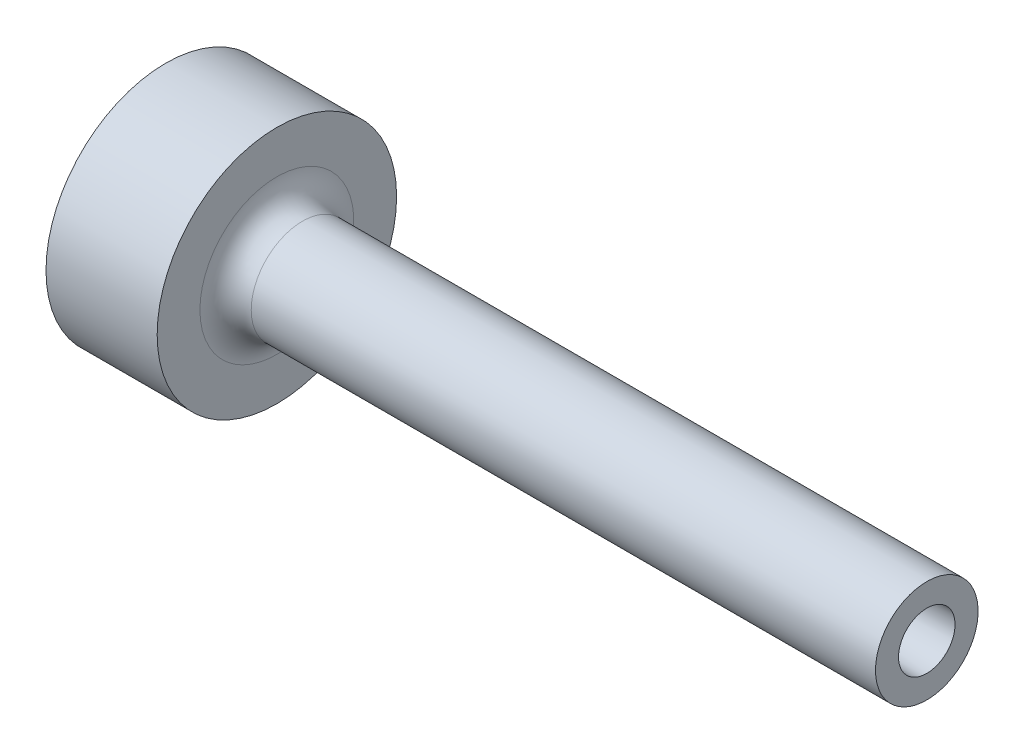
ISO-10303-21;
HEADER;
FILE_DESCRIPTION(('STEP AP214'),'2;1');
FILE_NAME('part.step','',(''),(''),'','','');
FILE_SCHEMA(('AUTOMOTIVE_DESIGN { 1 0 10303 214 1 1 1 1 }'));
ENDSEC;
DATA;
#1=APPLICATION_CONTEXT('core data for automotive mechanical design processes');
#2=APPLICATION_PROTOCOL_DEFINITION('international standard','automotive_design',2000,#1);
#3=PRODUCT_CONTEXT('',#1,'mechanical');
#4=PRODUCT('Part','Part','',(#3));
#5=PRODUCT_RELATED_PRODUCT_CATEGORY('part','',(#4));
#6=PRODUCT_DEFINITION_FORMATION('','',#4);
#7=PRODUCT_DEFINITION_CONTEXT('part definition',#1,'design');
#8=PRODUCT_DEFINITION('design','',#6,#7);
#9=PRODUCT_DEFINITION_SHAPE('','',#8);
#10=(LENGTH_UNIT() NAMED_UNIT(*) SI_UNIT(.MILLI.,.METRE.));
#11=(NAMED_UNIT(*) PLANE_ANGLE_UNIT() SI_UNIT($,.RADIAN.));
#12=(NAMED_UNIT(*) SI_UNIT($,.STERADIAN.) SOLID_ANGLE_UNIT());
#13=UNCERTAINTY_MEASURE_WITH_UNIT(LENGTH_MEASURE(1.E-05),#10,'distance_accuracy_value','');
#14=(GEOMETRIC_REPRESENTATION_CONTEXT(3) GLOBAL_UNCERTAINTY_ASSIGNED_CONTEXT((#13)) GLOBAL_UNIT_ASSIGNED_CONTEXT((#10,
#11,#12)) REPRESENTATION_CONTEXT('',''));
#15=CARTESIAN_POINT('',(0.,0.,0.));
#16=DIRECTION('',(0.,0.,1.));
#17=DIRECTION('',(1.,0.,0.));
#18=AXIS2_PLACEMENT_3D('',#15,#16,#17);
#19=CARTESIAN_POINT('',(0.,0.,0.));
#20=DIRECTION('',(-1.,0.,0.));
#21=DIRECTION('',(0.,0.,1.));
#22=AXIS2_PLACEMENT_3D('',#19,#20,#21);
#23=CYLINDRICAL_SURFACE('',#22,14.);
#24=CARTESIAN_POINT('',(13.,0.,0.));
#25=DIRECTION('',(-1.,0.,0.));
#26=DIRECTION('',(0.,0.,1.));
#27=AXIS2_PLACEMENT_3D('',#24,#25,#26);
#28=CIRCLE('',#27,14.);
#29=CARTESIAN_POINT('',(13.,0.,14.));
#30=VERTEX_POINT('',#29);
#31=EDGE_CURVE('E88',#30,#30,#28,.T.);
#32=ORIENTED_EDGE('',*,*,#31,.T.);
#33=EDGE_LOOP('',(#32));
#34=FACE_BOUND('',#33,.T.);
#35=CARTESIAN_POINT('',(0.,0.,0.));
#36=DIRECTION('',(-1.,0.,0.));
#37=DIRECTION('',(0.,0.,1.));
#38=AXIS2_PLACEMENT_3D('',#35,#36,#37);
#39=CIRCLE('',#38,14.);
#40=CARTESIAN_POINT('',(0.,0.,14.));
#41=VERTEX_POINT('',#40);
#42=EDGE_CURVE('E83',#41,#41,#39,.T.);
#43=ORIENTED_EDGE('',*,*,#42,.F.);
#44=EDGE_LOOP('',(#43));
#45=FACE_BOUND('',#44,.T.);
#46=CARTESIAN_POINT('',(6.5,-13.856406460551,-2.));
#47=CARTESIAN_POINT('',(6.61172417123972,-13.8564082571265,-1.99999534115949));
#48=CARTESIAN_POINT('',(6.72351471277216,-13.8577723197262,-1.99060664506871));
#49=CARTESIAN_POINT('',(6.9439746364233,-13.8630779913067,-1.95330740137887));
#50=CARTESIAN_POINT('',(7.05264079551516,-13.8670221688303,-1.92537839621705));
#51=CARTESIAN_POINT('',(7.26362870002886,-13.8770324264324,-1.85184738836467));
#52=CARTESIAN_POINT('',(7.36595507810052,-13.8830969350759,-1.80625847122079));
#53=CARTESIAN_POINT('',(7.56148972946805,-13.8966626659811,-1.69873175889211));
#54=CARTESIAN_POINT('',(7.65469934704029,-13.9041636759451,-1.63679637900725));
#55=CARTESIAN_POINT('',(7.83004829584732,-13.9198182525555,-1.49785346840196));
#56=CARTESIAN_POINT('',(7.91211171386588,-13.9279757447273,-1.42075056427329));
#57=CARTESIAN_POINT('',(8.06218155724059,-13.9439890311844,-1.25386707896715));
#58=CARTESIAN_POINT('',(8.13018723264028,-13.9518448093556,-1.16408582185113));
#59=CARTESIAN_POINT('',(8.25048909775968,-13.9664103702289,-0.973910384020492));
#60=CARTESIAN_POINT('',(8.30271571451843,-13.9731150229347,-0.873471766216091));
#61=CARTESIAN_POINT('',(8.38953073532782,-13.9845795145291,-0.665136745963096));
#62=CARTESIAN_POINT('',(8.4241199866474,-13.9893394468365,-0.557240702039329));
#63=CARTESIAN_POINT('',(8.47444920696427,-13.9963505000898,-0.337834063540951));
#64=CARTESIAN_POINT('',(8.49031606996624,-13.9986185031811,-0.226353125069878));
#65=CARTESIAN_POINT('',(8.5031438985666,-14.0004479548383,-0.00228956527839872));
#66=CARTESIAN_POINT('',(8.50010582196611,-14.0000095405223,0.110292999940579));
#67=CARTESIAN_POINT('',(8.47531062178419,-13.9964890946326,0.33249899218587));
#68=CARTESIAN_POINT('',(8.45369000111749,-13.9934263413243,0.442137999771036));
#69=CARTESIAN_POINT('',(8.39255744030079,-13.9850228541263,0.656215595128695));
#70=CARTESIAN_POINT('',(8.3530450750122,-13.9796820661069,0.760654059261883));
#71=CARTESIAN_POINT('',(8.25710925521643,-13.9672894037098,0.961781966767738));
#72=CARTESIAN_POINT('',(8.20062784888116,-13.9602316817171,1.05844339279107));
#73=CARTESIAN_POINT('',(8.07239950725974,-13.9451926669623,1.24096782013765));
#74=CARTESIAN_POINT('',(8.00065165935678,-13.9372113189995,1.32683017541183));
#75=CARTESIAN_POINT('',(7.843165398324,-13.921132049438,1.48612299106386));
#76=CARTESIAN_POINT('',(7.75730786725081,-13.9130337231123,1.55943569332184));
#77=CARTESIAN_POINT('',(7.57444547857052,-13.8977029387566,1.69062989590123));
#78=CARTESIAN_POINT('',(7.47744056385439,-13.890470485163,1.74851131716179));
#79=CARTESIAN_POINT('',(7.27491971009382,-13.8776905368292,1.84721301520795));
#80=CARTESIAN_POINT('',(7.1693981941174,-13.8721441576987,1.88802200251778));
#81=CARTESIAN_POINT('',(6.95290242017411,-13.8633846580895,1.9513062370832));
#82=CARTESIAN_POINT('',(6.84192850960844,-13.8601713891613,1.97378265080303));
#83=CARTESIAN_POINT('',(6.61872346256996,-13.8564698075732,1.99960390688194));
#84=CARTESIAN_POINT('',(6.50651197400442,-13.8559577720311,2.00311531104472));
#85=CARTESIAN_POINT('',(6.28310219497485,-13.8576537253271,1.9913480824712));
#86=CARTESIAN_POINT('',(6.17190387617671,-13.8598616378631,1.9760699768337));
#87=CARTESIAN_POINT('',(5.95418781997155,-13.8667269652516,1.92729837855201));
#88=CARTESIAN_POINT('',(5.84765127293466,-13.8713733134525,1.8938871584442));
#89=CARTESIAN_POINT('',(5.6416912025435,-13.8825829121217,1.80988306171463));
#90=CARTESIAN_POINT('',(5.54226800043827,-13.8891462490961,1.75928940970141));
#91=CARTESIAN_POINT('',(5.35260812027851,-13.9035064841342,1.64195360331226));
#92=CARTESIAN_POINT('',(5.26243903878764,-13.911311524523,1.57510320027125));
#93=CARTESIAN_POINT('',(5.09454027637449,-13.9272509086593,1.42730277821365));
#94=CARTESIAN_POINT('',(5.01681123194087,-13.9353852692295,1.34635203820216));
#95=CARTESIAN_POINT('',(4.8754047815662,-13.9511405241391,1.17191708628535));
#96=CARTESIAN_POINT('',(4.81183747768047,-13.9587570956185,1.07834317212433));
#97=CARTESIAN_POINT('',(4.70132443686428,-13.972552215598,0.881748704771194));
#98=CARTESIAN_POINT('',(4.65437828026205,-13.9787308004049,0.778728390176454));
#99=CARTESIAN_POINT('',(4.57861788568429,-13.9889347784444,0.566515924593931));
#100=CARTESIAN_POINT('',(4.54974241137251,-13.9929674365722,0.457345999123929));
#101=CARTESIAN_POINT('',(4.51074453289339,-13.9984555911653,0.235645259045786));
#102=CARTESIAN_POINT('',(4.50062101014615,-13.9999112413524,0.123114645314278));
#103=CARTESIAN_POINT('',(4.49943976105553,-14.0000800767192,-0.101043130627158));
#104=CARTESIAN_POINT('',(4.50821318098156,-13.998817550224,-0.212669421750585));
#105=CARTESIAN_POINT('',(4.54421615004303,-13.9937406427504,-0.432842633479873));
#106=CARTESIAN_POINT('',(4.57144565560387,-13.989926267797,-0.541389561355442));
#107=CARTESIAN_POINT('',(4.6435299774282,-13.9801722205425,-0.752283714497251));
#108=CARTESIAN_POINT('',(4.68837418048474,-13.9742338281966,-0.854634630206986));
#109=CARTESIAN_POINT('',(4.79439714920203,-13.960885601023,-1.05038570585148));
#110=CARTESIAN_POINT('',(4.8555763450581,-13.9534757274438,-1.14378562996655));
#111=CARTESIAN_POINT('',(4.99314771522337,-13.9379304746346,-1.31984194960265));
#112=CARTESIAN_POINT('',(5.06966490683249,-13.9297894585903,-1.40240016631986));
#113=CARTESIAN_POINT('',(5.2354775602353,-13.9137422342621,-1.55356716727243));
#114=CARTESIAN_POINT('',(5.32477602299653,-13.9058360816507,-1.6221726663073));
#115=CARTESIAN_POINT('',(5.51414543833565,-13.8911108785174,-1.74379523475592));
#116=CARTESIAN_POINT('',(5.61426869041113,-13.8842975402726,-1.79673154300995));
#117=CARTESIAN_POINT('',(5.82203229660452,-13.8725962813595,-1.88495902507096));
#118=CARTESIAN_POINT('',(5.92966459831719,-13.8677063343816,-1.92026877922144));
#119=CARTESIAN_POINT('',(6.11483642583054,-13.8615529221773,-1.96409255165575));
#120=CARTESIAN_POINT('',(6.19122433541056,-13.859633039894,-1.97753762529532));
#121=CARTESIAN_POINT('',(6.34506419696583,-13.857059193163,-1.99549291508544));
#122=CARTESIAN_POINT('',(6.42251613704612,-13.8564052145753,-2.00000323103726));
#123=CARTESIAN_POINT('',(6.5,-13.856406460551,-2.));
#124=B_SPLINE_CURVE_WITH_KNOTS('',3,(#46,#47,#48,#49,#50,#51,#52,#53,#54,#55,#56,#57,#58,#59,
#60,#61,#62,#63,#64,#65,#66,#67,#68,#69,#70,#71,#72,#73,#74,#75,#76,#77,#78,#79,#80,#81,#82,#83,
#84,#85,#86,#87,#88,#89,#90,#91,#92,#93,#94,#95,#96,#97,#98,#99,#100,#101,#102,#103,#104,#105,
#106,#107,#108,#109,#110,#111,#112,#113,#114,#115,#116,#117,#118,#119,#120,#121,#122,#123),
.UNSPECIFIED.,.T.,.F.,(4,2,2,2,2,2,2,2,2,2,2,2,2,2,2,2,2,2,2,2,2,2,2,2,2,2,2,2,2,2,2,2,2,2,2,2,
2,2,4),(0.,0.334889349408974,0.670112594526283,1.00508792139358,1.34001378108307,
1.6771171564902,2.01423851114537,2.35282530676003,2.6913958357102,3.02765822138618,
3.36390357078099,3.69769984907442,4.03150405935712,4.36646147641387,4.70143892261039,
5.03940517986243,5.37737316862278,5.7155642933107,6.05373389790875,6.3889286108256,
6.72411392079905,7.05779100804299,7.39148315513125,7.72746121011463,8.06345644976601,
8.40197921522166,8.74049343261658,9.07785422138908,9.41519488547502,9.74953375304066,
10.083871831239,10.4180087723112,10.7521545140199,11.0891434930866,11.426211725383,
11.7649881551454,12.103406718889,12.3356645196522,12.5679197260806),.UNSPECIFIED.);
#125=CARTESIAN_POINT('',(6.5,-13.856406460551,-2.));
#126=VERTEX_POINT('',#125);
#127=EDGE_CURVE('E9',#126,#126,#124,.T.);
#128=ORIENTED_EDGE('',*,*,#127,.F.);
#129=EDGE_LOOP('',(#128));
#130=FACE_BOUND('',#129,.T.);
#131=ADVANCED_FACE('F15',(#34,#45,#130),#23,.T.);
#132=CARTESIAN_POINT('',(0.,0.,0.));
#133=DIRECTION('',(1.,0.,0.));
#134=DIRECTION('',(0.,0.,-1.));
#135=AXIS2_PLACEMENT_3D('',#132,#133,#134);
#136=CONICAL_SURFACE('',#135,1.75,0.0174532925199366);
#137=CARTESIAN_POINT('',(89.,0.,0.));
#138=DIRECTION('',(-1.,0.,0.));
#139=DIRECTION('',(0.,0.,1.));
#140=AXIS2_PLACEMENT_3D('',#137,#138,#139);
#141=CIRCLE('',#140,3.30350077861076);
#142=CARTESIAN_POINT('',(89.,0.,3.30350077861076));
#143=VERTEX_POINT('',#142);
#144=EDGE_CURVE('E80',#143,#143,#141,.T.);
#145=ORIENTED_EDGE('',*,*,#144,.F.);
#146=EDGE_LOOP('',(#145));
#147=FACE_BOUND('',#146,.T.);
#148=CARTESIAN_POINT('',(1.08679639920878,0.,0.));
#149=DIRECTION('',(-1.,0.,0.));
#150=DIRECTION('',(0.,0.,1.));
#151=AXIS2_PLACEMENT_3D('',#148,#149,#150);
#152=CIRCLE('',#151,1.76897010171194);
#153=CARTESIAN_POINT('',(1.08679639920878,0.,1.76897010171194));
#154=VERTEX_POINT('',#153);
#155=EDGE_CURVE('E93',#154,#154,#152,.F.);
#156=ORIENTED_EDGE('',*,*,#155,.F.);
#157=EDGE_LOOP('',(#156));
#158=FACE_BOUND('',#157,.T.);
#159=ADVANCED_FACE('F44',(#147,#158),#136,.F.);
#160=CARTESIAN_POINT('',(16.,0.,0.));
#161=DIRECTION('',(-1.,0.,0.));
#162=DIRECTION('',(0.,0.,1.));
#163=AXIS2_PLACEMENT_3D('',#160,#161,#162);
#164=TOROIDAL_SURFACE('',#163,9.,3.);
#165=CARTESIAN_POINT('',(13.,0.,0.));
#166=DIRECTION('',(-1.,0.,0.));
#167=DIRECTION('',(0.,0.,1.));
#168=AXIS2_PLACEMENT_3D('',#165,#166,#167);
#169=CIRCLE('',#168,9.);
#170=CARTESIAN_POINT('',(13.,0.,9.));
#171=VERTEX_POINT('',#170);
#172=EDGE_CURVE('E90',#171,#171,#169,.T.);
#173=ORIENTED_EDGE('',*,*,#172,.F.);
#174=EDGE_LOOP('',(#173));
#175=FACE_BOUND('',#174,.T.);
#176=CARTESIAN_POINT('',(16.,0.,0.));
#177=DIRECTION('',(-1.,0.,0.));
#178=DIRECTION('',(0.,0.,1.));
#179=AXIS2_PLACEMENT_3D('',#176,#177,#178);
#180=CIRCLE('',#179,6.);
#181=CARTESIAN_POINT('',(16.,0.,6.));
#182=VERTEX_POINT('',#181);
#183=EDGE_CURVE('E27',#182,#182,#180,.T.);
#184=ORIENTED_EDGE('',*,*,#183,.T.);
#185=EDGE_LOOP('',(#184));
#186=FACE_BOUND('',#185,.T.);
#187=ADVANCED_FACE('F17',(#175,#186),#164,.F.);
#188=CARTESIAN_POINT('',(0.,0.,0.));
#189=DIRECTION('',(-1.,0.,0.));
#190=DIRECTION('',(0.,0.,1.));
#191=AXIS2_PLACEMENT_3D('',#188,#189,#190);
#192=CYLINDRICAL_SURFACE('',#191,6.);
#193=ORIENTED_EDGE('',*,*,#183,.F.);
#194=EDGE_LOOP('',(#193));
#195=FACE_BOUND('',#194,.T.);
#196=CARTESIAN_POINT('',(89.,0.,0.));
#197=DIRECTION('',(-1.,0.,0.));
#198=DIRECTION('',(0.,0.,1.));
#199=AXIS2_PLACEMENT_3D('',#196,#197,#198);
#200=CIRCLE('',#199,6.);
#201=CARTESIAN_POINT('',(89.,0.,6.));
#202=VERTEX_POINT('',#201);
#203=EDGE_CURVE('E79',#202,#202,#200,.T.);
#204=ORIENTED_EDGE('',*,*,#203,.T.);
#205=EDGE_LOOP('',(#204));
#206=FACE_BOUND('',#205,.T.);
#207=ADVANCED_FACE('F65',(#195,#206),#192,.T.);
#208=CARTESIAN_POINT('',(89.,6.,0.));
#209=DIRECTION('',(-1.,0.,0.));
#210=DIRECTION('',(0.,0.,1.));
#211=AXIS2_PLACEMENT_3D('',#208,#209,#210);
#212=PLANE('',#211);
#213=ORIENTED_EDGE('',*,*,#203,.F.);
#214=EDGE_LOOP('',(#213));
#215=FACE_BOUND('',#214,.T.);
#216=ORIENTED_EDGE('',*,*,#144,.T.);
#217=EDGE_LOOP('',(#216));
#218=FACE_BOUND('',#217,.T.);
#219=ADVANCED_FACE('F61',(#215,#218),#212,.F.);
#220=CARTESIAN_POINT('',(0.,1.75,0.));
#221=DIRECTION('',(1.,0.,0.));
#222=DIRECTION('',(0.,0.,-1.));
#223=AXIS2_PLACEMENT_3D('',#220,#221,#222);
#224=PLANE('',#223);
#225=CARTESIAN_POINT('',(0.,0.,0.));
#226=DIRECTION('',(-1.,0.,0.));
#227=DIRECTION('',(0.,0.,1.));
#228=AXIS2_PLACEMENT_3D('',#225,#226,#227);
#229=CIRCLE('',#228,5.);
#230=CARTESIAN_POINT('',(0.,0.,5.));
#231=VERTEX_POINT('',#230);
#232=EDGE_CURVE('E96',#231,#231,#229,.T.);
#233=ORIENTED_EDGE('',*,*,#232,.F.);
#234=EDGE_LOOP('',(#233));
#235=FACE_BOUND('',#234,.T.);
#236=ORIENTED_EDGE('',*,*,#42,.T.);
#237=EDGE_LOOP('',(#236));
#238=FACE_BOUND('',#237,.T.);
#239=ADVANCED_FACE('F59',(#235,#238),#224,.F.);
#240=CARTESIAN_POINT('',(13.,14.,0.));
#241=DIRECTION('',(-1.,0.,0.));
#242=DIRECTION('',(0.,0.,1.));
#243=AXIS2_PLACEMENT_3D('',#240,#241,#242);
#244=PLANE('',#243);
#245=ORIENTED_EDGE('',*,*,#31,.F.);
#246=EDGE_LOOP('',(#245));
#247=FACE_BOUND('',#246,.T.);
#248=ORIENTED_EDGE('',*,*,#172,.T.);
#249=EDGE_LOOP('',(#248));
#250=FACE_BOUND('',#249,.T.);
#251=ADVANCED_FACE('F57',(#247,#250),#244,.F.);
#252=CARTESIAN_POINT('',(-37.3349076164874,0.,0.));
#253=DIRECTION('',(-1.,0.,0.));
#254=DIRECTION('',(0.,0.,1.));
#255=AXIS2_PLACEMENT_3D('',#252,#253,#254);
#256=DEGENERATE_TOROIDAL_SURFACE('',#255,9.35634609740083,40.,.F.);
#257=ORIENTED_EDGE('',*,*,#232,.T.);
#258=EDGE_LOOP('',(#257));
#259=FACE_BOUND('',#258,.T.);
#260=ORIENTED_EDGE('',*,*,#155,.T.);
#261=EDGE_LOOP('',(#260));
#262=FACE_BOUND('',#261,.T.);
#263=ADVANCED_FACE('F40',(#259,#262),#256,.T.);
#264=CARTESIAN_POINT('',(6.5,-14.,0.));
#265=DIRECTION('',(0.,-1.,0.));
#266=DIRECTION('',(0.,0.,-1.));
#267=AXIS2_PLACEMENT_3D('',#264,#265,#266);
#268=CYLINDRICAL_SURFACE('',#267,2.);
#269=CARTESIAN_POINT('',(6.5,-8.,0.));
#270=DIRECTION('',(0.,-1.,0.));
#271=DIRECTION('',(0.,0.,-1.));
#272=AXIS2_PLACEMENT_3D('',#269,#270,#271);
#273=CIRCLE('',#272,2.);
#274=CARTESIAN_POINT('',(6.5,-8.,-2.));
#275=VERTEX_POINT('',#274);
#276=EDGE_CURVE('E99',#275,#275,#273,.T.);
#277=ORIENTED_EDGE('',*,*,#276,.F.);
#278=EDGE_LOOP('',(#277));
#279=FACE_BOUND('',#278,.T.);
#280=ORIENTED_EDGE('',*,*,#127,.T.);
#281=EDGE_LOOP('',(#280));
#282=FACE_BOUND('',#281,.T.);
#283=ADVANCED_FACE('F32',(#279,#282),#268,.F.);
#284=CARTESIAN_POINT('',(6.5,-6.84529946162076,0.));
#285=DIRECTION('',(0.,-1.,0.));
#286=DIRECTION('',(0.,0.,-1.));
#287=AXIS2_PLACEMENT_3D('',#284,#285,#286);
#288=CONICAL_SURFACE('',#287,0.,1.0471975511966);
#289=ORIENTED_EDGE('',*,*,#276,.T.);
#290=EDGE_LOOP('',(#289));
#291=FACE_BOUND('',#290,.T.);
#292=CARTESIAN_POINT('',(6.5,-6.84529946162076,0.));
#293=VERTEX_POINT('',#292);
#294=VERTEX_LOOP('',#293);
#295=FACE_BOUND('',#294,.T.);
#296=ADVANCED_FACE('F30',(#291,#295),#288,.F.);
#297=CLOSED_SHELL('',(#131,#159,#187,#207,#219,#239,#251,#263,#283,#296));
#298=MANIFOLD_SOLID_BREP('B1',#297);
#299=ADVANCED_BREP_SHAPE_REPRESENTATION('',(#18,#298),#14);
#300=SHAPE_DEFINITION_REPRESENTATION(#9,#299);
ENDSEC;
END-ISO-10303-21;
